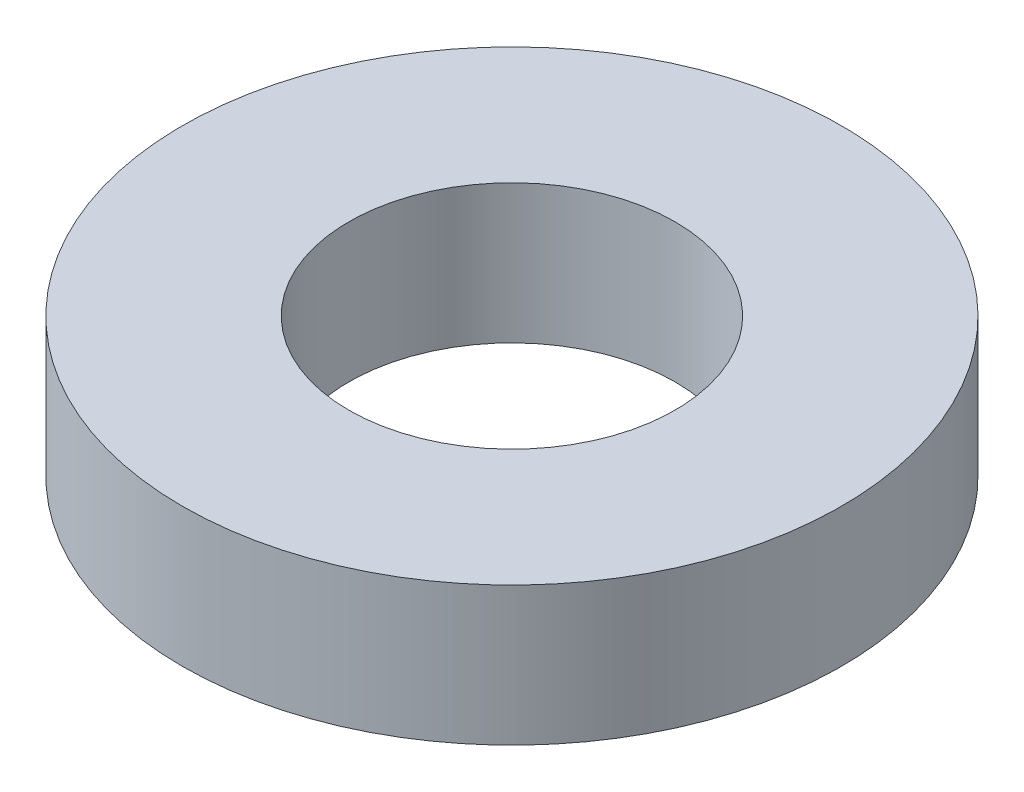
ISO-10303-21;
HEADER;
FILE_DESCRIPTION(('STEP AP214'),'2;1');
FILE_NAME('part.step','',(''),(''),'','','');
FILE_SCHEMA(('AUTOMOTIVE_DESIGN { 1 0 10303 214 1 1 1 1 }'));
ENDSEC;
DATA;
#1=APPLICATION_CONTEXT('core data for automotive mechanical design processes');
#2=APPLICATION_PROTOCOL_DEFINITION('international standard','automotive_design',2000,#1);
#3=PRODUCT_CONTEXT('',#1,'mechanical');
#4=PRODUCT('Part','Part','',(#3));
#5=PRODUCT_RELATED_PRODUCT_CATEGORY('part','',(#4));
#6=PRODUCT_DEFINITION_FORMATION('','',#4);
#7=PRODUCT_DEFINITION_CONTEXT('part definition',#1,'design');
#8=PRODUCT_DEFINITION('design','',#6,#7);
#9=PRODUCT_DEFINITION_SHAPE('','',#8);
#10=(LENGTH_UNIT() NAMED_UNIT(*) SI_UNIT(.MILLI.,.METRE.));
#11=(NAMED_UNIT(*) PLANE_ANGLE_UNIT() SI_UNIT($,.RADIAN.));
#12=(NAMED_UNIT(*) SI_UNIT($,.STERADIAN.) SOLID_ANGLE_UNIT());
#13=UNCERTAINTY_MEASURE_WITH_UNIT(LENGTH_MEASURE(1.E-05),#10,'distance_accuracy_value','');
#14=(GEOMETRIC_REPRESENTATION_CONTEXT(3) GLOBAL_UNCERTAINTY_ASSIGNED_CONTEXT((#13)) GLOBAL_UNIT_ASSIGNED_CONTEXT((#10,
#11,#12)) REPRESENTATION_CONTEXT('',''));
#15=CARTESIAN_POINT('',(0.,0.,0.));
#16=DIRECTION('',(0.,0.,1.));
#17=DIRECTION('',(1.,0.,0.));
#18=AXIS2_PLACEMENT_3D('',#15,#16,#17);
#19=CARTESIAN_POINT('',(0.,17.,0.));
#20=DIRECTION('',(0.,1.,0.));
#21=DIRECTION('',(0.,0.,1.));
#22=AXIS2_PLACEMENT_3D('',#19,#20,#21);
#23=PLANE('',#22);
#24=CARTESIAN_POINT('',(0.,17.,0.));
#25=DIRECTION('',(0.,1.,0.));
#26=DIRECTION('',(0.,0.,1.));
#27=AXIS2_PLACEMENT_3D('',#24,#25,#26);
#28=CIRCLE('',#27,40.4);
#29=CARTESIAN_POINT('',(0.,17.,40.4));
#30=VERTEX_POINT('',#29);
#31=EDGE_CURVE('E11',#30,#30,#28,.T.);
#32=ORIENTED_EDGE('',*,*,#31,.T.);
#33=EDGE_LOOP('',(#32));
#34=FACE_BOUND('',#33,.T.);
#35=CARTESIAN_POINT('',(0.,17.,0.));
#36=DIRECTION('',(0.,1.,0.));
#37=DIRECTION('',(0.,0.,1.));
#38=AXIS2_PLACEMENT_3D('',#35,#36,#37);
#39=CIRCLE('',#38,20.);
#40=CARTESIAN_POINT('',(0.,17.,20.));
#41=VERTEX_POINT('',#40);
#42=EDGE_CURVE('E58',#41,#41,#39,.T.);
#43=ORIENTED_EDGE('',*,*,#42,.F.);
#44=EDGE_LOOP('',(#43));
#45=FACE_BOUND('',#44,.T.);
#46=ADVANCED_FACE('F45',(#34,#45),#23,.T.);
#47=CARTESIAN_POINT('',(0.,0.,0.));
#48=DIRECTION('',(0.,1.,0.));
#49=DIRECTION('',(0.,0.,1.));
#50=AXIS2_PLACEMENT_3D('',#47,#48,#49);
#51=PLANE('',#50);
#52=CARTESIAN_POINT('',(0.,0.,0.));
#53=DIRECTION('',(0.,1.,0.));
#54=DIRECTION('',(0.,0.,1.));
#55=AXIS2_PLACEMENT_3D('',#52,#53,#54);
#56=CIRCLE('',#55,40.4);
#57=CARTESIAN_POINT('',(0.,0.,40.4));
#58=VERTEX_POINT('',#57);
#59=EDGE_CURVE('E49',#58,#58,#56,.T.);
#60=ORIENTED_EDGE('',*,*,#59,.F.);
#61=EDGE_LOOP('',(#60));
#62=FACE_BOUND('',#61,.T.);
#63=CARTESIAN_POINT('',(0.,0.,0.));
#64=DIRECTION('',(0.,1.,0.));
#65=DIRECTION('',(0.,0.,1.));
#66=AXIS2_PLACEMENT_3D('',#63,#64,#65);
#67=CIRCLE('',#66,20.);
#68=CARTESIAN_POINT('',(0.,0.,20.));
#69=VERTEX_POINT('',#68);
#70=EDGE_CURVE('E60',#69,#69,#67,.T.);
#71=ORIENTED_EDGE('',*,*,#70,.T.);
#72=EDGE_LOOP('',(#71));
#73=FACE_BOUND('',#72,.T.);
#74=ADVANCED_FACE('F72',(#62,#73),#51,.F.);
#75=CARTESIAN_POINT('',(0.,17.,0.));
#76=DIRECTION('',(0.,-1.,0.));
#77=DIRECTION('',(0.,0.,-1.));
#78=AXIS2_PLACEMENT_3D('',#75,#76,#77);
#79=CYLINDRICAL_SURFACE('',#78,40.4);
#80=ORIENTED_EDGE('',*,*,#31,.F.);
#81=EDGE_LOOP('',(#80));
#82=FACE_BOUND('',#81,.T.);
#83=ORIENTED_EDGE('',*,*,#59,.T.);
#84=EDGE_LOOP('',(#83));
#85=FACE_BOUND('',#84,.T.);
#86=ADVANCED_FACE('F47',(#82,#85),#79,.T.);
#87=CARTESIAN_POINT('',(0.,17.,0.));
#88=DIRECTION('',(0.,-1.,0.));
#89=DIRECTION('',(0.,0.,-1.));
#90=AXIS2_PLACEMENT_3D('',#87,#88,#89);
#91=CYLINDRICAL_SURFACE('',#90,20.);
#92=ORIENTED_EDGE('',*,*,#42,.T.);
#93=EDGE_LOOP('',(#92));
#94=FACE_BOUND('',#93,.T.);
#95=ORIENTED_EDGE('',*,*,#70,.F.);
#96=EDGE_LOOP('',(#95));
#97=FACE_BOUND('',#96,.T.);
#98=ADVANCED_FACE('F68',(#94,#97),#91,.F.);
#99=CLOSED_SHELL('',(#46,#74,#86,#98));
#100=MANIFOLD_SOLID_BREP('B2',#99);
#101=ADVANCED_BREP_SHAPE_REPRESENTATION('',(#18,#100),#14);
#102=SHAPE_DEFINITION_REPRESENTATION(#9,#101);
ENDSEC;
END-ISO-10303-21;
